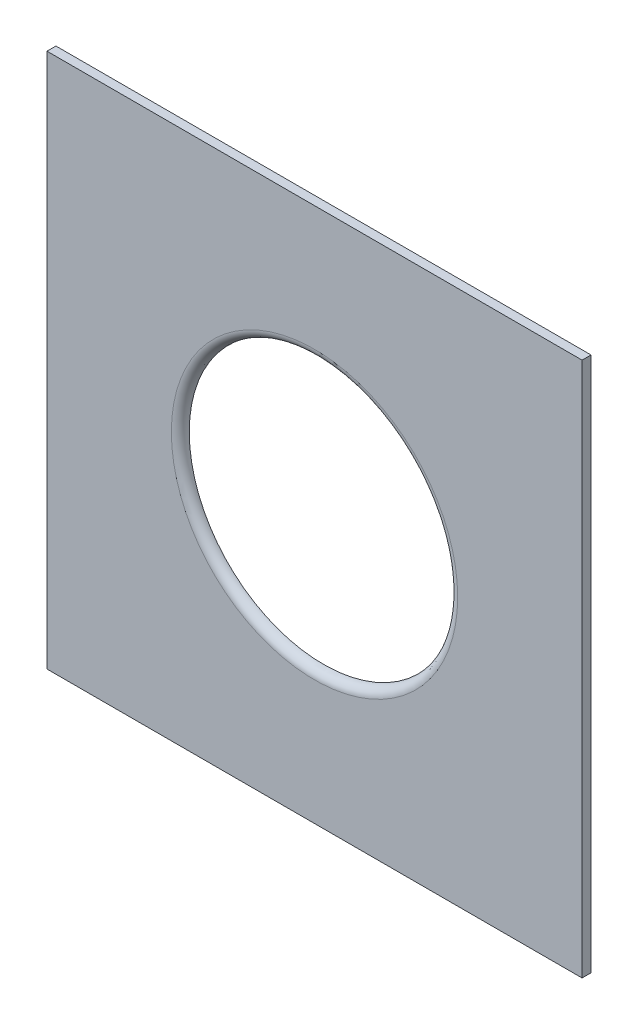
ISO-10303-21;
HEADER;
FILE_DESCRIPTION(('STEP AP214'),'2;1');
FILE_NAME('part.step','',(''),(''),'','','');
FILE_SCHEMA(('AUTOMOTIVE_DESIGN { 1 0 10303 214 1 1 1 1 }'));
ENDSEC;
DATA;
#1=APPLICATION_CONTEXT('core data for automotive mechanical design processes');
#2=APPLICATION_PROTOCOL_DEFINITION('international standard','automotive_design',2000,#1);
#3=PRODUCT_CONTEXT('',#1,'mechanical');
#4=PRODUCT('Part','Part','',(#3));
#5=PRODUCT_RELATED_PRODUCT_CATEGORY('part','',(#4));
#6=PRODUCT_DEFINITION_FORMATION('','',#4);
#7=PRODUCT_DEFINITION_CONTEXT('part definition',#1,'design');
#8=PRODUCT_DEFINITION('design','',#6,#7);
#9=PRODUCT_DEFINITION_SHAPE('','',#8);
#10=(LENGTH_UNIT() NAMED_UNIT(*) SI_UNIT(.MILLI.,.METRE.));
#11=(NAMED_UNIT(*) PLANE_ANGLE_UNIT() SI_UNIT($,.RADIAN.));
#12=(NAMED_UNIT(*) SI_UNIT($,.STERADIAN.) SOLID_ANGLE_UNIT());
#13=UNCERTAINTY_MEASURE_WITH_UNIT(LENGTH_MEASURE(1.E-05),#10,'distance_accuracy_value','');
#14=(GEOMETRIC_REPRESENTATION_CONTEXT(3) GLOBAL_UNCERTAINTY_ASSIGNED_CONTEXT((#13)) GLOBAL_UNIT_ASSIGNED_CONTEXT((#10,
#11,#12)) REPRESENTATION_CONTEXT('',''));
#15=CARTESIAN_POINT('',(0.,0.,0.));
#16=DIRECTION('',(0.,0.,1.));
#17=DIRECTION('',(1.,0.,0.));
#18=AXIS2_PLACEMENT_3D('',#15,#16,#17);
#19=CARTESIAN_POINT('',(0.,0.,0.1));
#20=DIRECTION('',(0.,0.,1.));
#21=DIRECTION('',(1.,0.,0.));
#22=AXIS2_PLACEMENT_3D('',#19,#20,#21);
#23=PLANE('',#22);
#24=CARTESIAN_POINT('',(0.,0.,0.1));
#25=DIRECTION('',(0.,0.,1.));
#26=DIRECTION('',(1.,0.,0.));
#27=AXIS2_PLACEMENT_3D('',#24,#25,#26);
#28=CIRCLE('',#27,1.6);
#29=CARTESIAN_POINT('',(1.6,0.,0.1));
#30=VERTEX_POINT('',#29);
#31=EDGE_CURVE('E83',#30,#30,#28,.T.);
#32=ORIENTED_EDGE('',*,*,#31,.F.);
#33=EDGE_LOOP('',(#32));
#34=FACE_BOUND('',#33,.T.);
#35=DIRECTION('',(0.,-1.,0.));
#36=VECTOR('',#35,1.);
#37=CARTESIAN_POINT('',(-2.99,2.99,0.1));
#38=LINE('',#37,#36);
#39=CARTESIAN_POINT('',(-2.99,-2.99,0.1));
#40=VERTEX_POINT('',#39);
#41=CARTESIAN_POINT('',(-2.99,2.99,0.1));
#42=VERTEX_POINT('',#41);
#43=EDGE_CURVE('E62',#40,#42,#38,.F.);
#44=ORIENTED_EDGE('',*,*,#43,.F.);
#45=DIRECTION('',(1.,0.,0.));
#46=VECTOR('',#45,1.);
#47=CARTESIAN_POINT('',(-2.99,-2.99,0.1));
#48=LINE('',#47,#46);
#49=CARTESIAN_POINT('',(2.99,-2.99,0.1));
#50=VERTEX_POINT('',#49);
#51=EDGE_CURVE('E75',#50,#40,#48,.F.);
#52=ORIENTED_EDGE('',*,*,#51,.F.);
#53=DIRECTION('',(0.,1.,0.));
#54=VECTOR('',#53,1.);
#55=CARTESIAN_POINT('',(2.99,-2.99,0.1));
#56=LINE('',#55,#54);
#57=CARTESIAN_POINT('',(2.99,2.99,0.1));
#58=VERTEX_POINT('',#57);
#59=EDGE_CURVE('E50',#58,#50,#56,.F.);
#60=ORIENTED_EDGE('',*,*,#59,.F.);
#61=DIRECTION('',(1.,0.,0.));
#62=VECTOR('',#61,1.);
#63=CARTESIAN_POINT('',(2.99,2.99,0.1));
#64=LINE('',#63,#62);
#65=EDGE_CURVE('E70',#42,#58,#64,.T.);
#66=ORIENTED_EDGE('',*,*,#65,.F.);
#67=EDGE_LOOP('',(#44,#52,#60,#66));
#68=FACE_BOUND('',#67,.T.);
#69=ADVANCED_FACE('F15',(#34,#68),#23,.T.);
#70=CARTESIAN_POINT('',(2.99,2.99,0.));
#71=DIRECTION('',(0.,1.,0.));
#72=DIRECTION('',(0.,0.,1.));
#73=AXIS2_PLACEMENT_3D('',#70,#71,#72);
#74=PLANE('',#73);
#75=ORIENTED_EDGE('',*,*,#65,.T.);
#76=DIRECTION('',(0.,0.,-1.));
#77=VECTOR('',#76,1.);
#78=CARTESIAN_POINT('',(2.99,2.99,0.));
#79=LINE('',#78,#77);
#80=CARTESIAN_POINT('',(2.99,2.99,0.));
#81=VERTEX_POINT('',#80);
#82=EDGE_CURVE('E80',#81,#58,#79,.F.);
#83=ORIENTED_EDGE('',*,*,#82,.F.);
#84=DIRECTION('',(1.,0.,0.));
#85=VECTOR('',#84,1.);
#86=CARTESIAN_POINT('',(0.,2.99,0.));
#87=LINE('',#86,#85);
#88=CARTESIAN_POINT('',(-2.99,2.99,0.));
#89=VERTEX_POINT('',#88);
#90=EDGE_CURVE('E45',#81,#89,#87,.F.);
#91=ORIENTED_EDGE('',*,*,#90,.T.);
#92=DIRECTION('',(0.,0.,1.));
#93=VECTOR('',#92,1.);
#94=CARTESIAN_POINT('',(-2.99,2.99,0.));
#95=LINE('',#94,#93);
#96=EDGE_CURVE('E67',#42,#89,#95,.F.);
#97=ORIENTED_EDGE('',*,*,#96,.F.);
#98=EDGE_LOOP('',(#75,#83,#91,#97));
#99=FACE_BOUND('',#98,.T.);
#100=ADVANCED_FACE('F74',(#99),#74,.T.);
#101=CARTESIAN_POINT('',(-2.99,2.99,0.));
#102=DIRECTION('',(-1.,0.,0.));
#103=DIRECTION('',(0.,-1.,0.));
#104=AXIS2_PLACEMENT_3D('',#101,#102,#103);
#105=PLANE('',#104);
#106=ORIENTED_EDGE('',*,*,#43,.T.);
#107=ORIENTED_EDGE('',*,*,#96,.T.);
#108=DIRECTION('',(0.,1.,0.));
#109=VECTOR('',#108,1.);
#110=CARTESIAN_POINT('',(-2.99,0.,0.));
#111=LINE('',#110,#109);
#112=CARTESIAN_POINT('',(-2.99,-2.99,0.));
#113=VERTEX_POINT('',#112);
#114=EDGE_CURVE('E108',#89,#113,#111,.F.);
#115=ORIENTED_EDGE('',*,*,#114,.T.);
#116=DIRECTION('',(0.,0.,-1.));
#117=VECTOR('',#116,1.);
#118=CARTESIAN_POINT('',(-2.99,-2.99,0.));
#119=LINE('',#118,#117);
#120=EDGE_CURVE('E68',#40,#113,#119,.T.);
#121=ORIENTED_EDGE('',*,*,#120,.F.);
#122=EDGE_LOOP('',(#106,#107,#115,#121));
#123=FACE_BOUND('',#122,.T.);
#124=ADVANCED_FACE('F64',(#123),#105,.T.);
#125=CARTESIAN_POINT('',(-2.99,-2.99,0.));
#126=DIRECTION('',(0.,-1.,0.));
#127=DIRECTION('',(0.,0.,-1.));
#128=AXIS2_PLACEMENT_3D('',#125,#126,#127);
#129=PLANE('',#128);
#130=ORIENTED_EDGE('',*,*,#51,.T.);
#131=ORIENTED_EDGE('',*,*,#120,.T.);
#132=DIRECTION('',(1.,0.,0.));
#133=VECTOR('',#132,1.);
#134=CARTESIAN_POINT('',(0.,-2.99,0.));
#135=LINE('',#134,#133);
#136=CARTESIAN_POINT('',(2.99,-2.99,0.));
#137=VERTEX_POINT('',#136);
#138=EDGE_CURVE('E109',#113,#137,#135,.T.);
#139=ORIENTED_EDGE('',*,*,#138,.T.);
#140=DIRECTION('',(0.,0.,-1.));
#141=VECTOR('',#140,1.);
#142=CARTESIAN_POINT('',(2.99,-2.99,0.));
#143=LINE('',#142,#141);
#144=EDGE_CURVE('E32',#50,#137,#143,.T.);
#145=ORIENTED_EDGE('',*,*,#144,.F.);
#146=EDGE_LOOP('',(#130,#131,#139,#145));
#147=FACE_BOUND('',#146,.T.);
#148=ADVANCED_FACE('F133',(#147),#129,.T.);
#149=CARTESIAN_POINT('',(2.99,-2.99,0.));
#150=DIRECTION('',(1.,0.,0.));
#151=DIRECTION('',(0.,0.,-1.));
#152=AXIS2_PLACEMENT_3D('',#149,#150,#151);
#153=PLANE('',#152);
#154=ORIENTED_EDGE('',*,*,#59,.T.);
#155=ORIENTED_EDGE('',*,*,#144,.T.);
#156=DIRECTION('',(0.,1.,0.));
#157=VECTOR('',#156,1.);
#158=CARTESIAN_POINT('',(2.99,0.,0.));
#159=LINE('',#158,#157);
#160=EDGE_CURVE('E24',#137,#81,#159,.T.);
#161=ORIENTED_EDGE('',*,*,#160,.T.);
#162=ORIENTED_EDGE('',*,*,#82,.T.);
#163=EDGE_LOOP('',(#154,#155,#161,#162));
#164=FACE_BOUND('',#163,.T.);
#165=ADVANCED_FACE('F93',(#164),#153,.T.);
#166=CARTESIAN_POINT('',(0.,0.,0.));
#167=DIRECTION('',(0.,0.,-1.));
#168=DIRECTION('',(-1.,0.,0.));
#169=AXIS2_PLACEMENT_3D('',#166,#167,#168);
#170=TOROIDAL_SURFACE('',#169,1.6,0.1);
#171=ORIENTED_EDGE('',*,*,#31,.T.);
#172=EDGE_LOOP('',(#171));
#173=FACE_BOUND('',#172,.T.);
#174=CARTESIAN_POINT('',(0.,0.,0.));
#175=DIRECTION('',(0.,0.,-1.));
#176=DIRECTION('',(-1.,0.,0.));
#177=AXIS2_PLACEMENT_3D('',#174,#175,#176);
#178=CIRCLE('',#177,1.5);
#179=CARTESIAN_POINT('',(-1.5,0.,0.));
#180=VERTEX_POINT('',#179);
#181=EDGE_CURVE('E10',#180,#180,#178,.T.);
#182=ORIENTED_EDGE('',*,*,#181,.T.);
#183=EDGE_LOOP('',(#182));
#184=FACE_BOUND('',#183,.T.);
#185=ADVANCED_FACE('F89',(#173,#184),#170,.T.);
#186=CARTESIAN_POINT('',(0.,0.,0.));
#187=DIRECTION('',(0.,0.,1.));
#188=DIRECTION('',(1.,0.,0.));
#189=AXIS2_PLACEMENT_3D('',#186,#187,#188);
#190=PLANE('',#189);
#191=ORIENTED_EDGE('',*,*,#181,.F.);
#192=EDGE_LOOP('',(#191));
#193=FACE_BOUND('',#192,.T.);
#194=ORIENTED_EDGE('',*,*,#138,.F.);
#195=ORIENTED_EDGE('',*,*,#114,.F.);
#196=ORIENTED_EDGE('',*,*,#90,.F.);
#197=ORIENTED_EDGE('',*,*,#160,.F.);
#198=EDGE_LOOP('',(#194,#195,#196,#197));
#199=FACE_BOUND('',#198,.T.);
#200=ADVANCED_FACE('F17',(#193,#199),#190,.F.);
#201=CLOSED_SHELL('',(#69,#100,#124,#148,#165,#185,#200));
#202=MANIFOLD_SOLID_BREP('B1',#201);
#203=ADVANCED_BREP_SHAPE_REPRESENTATION('',(#18,#202),#14);
#204=SHAPE_DEFINITION_REPRESENTATION(#9,#203);
ENDSEC;
END-ISO-10303-21;
